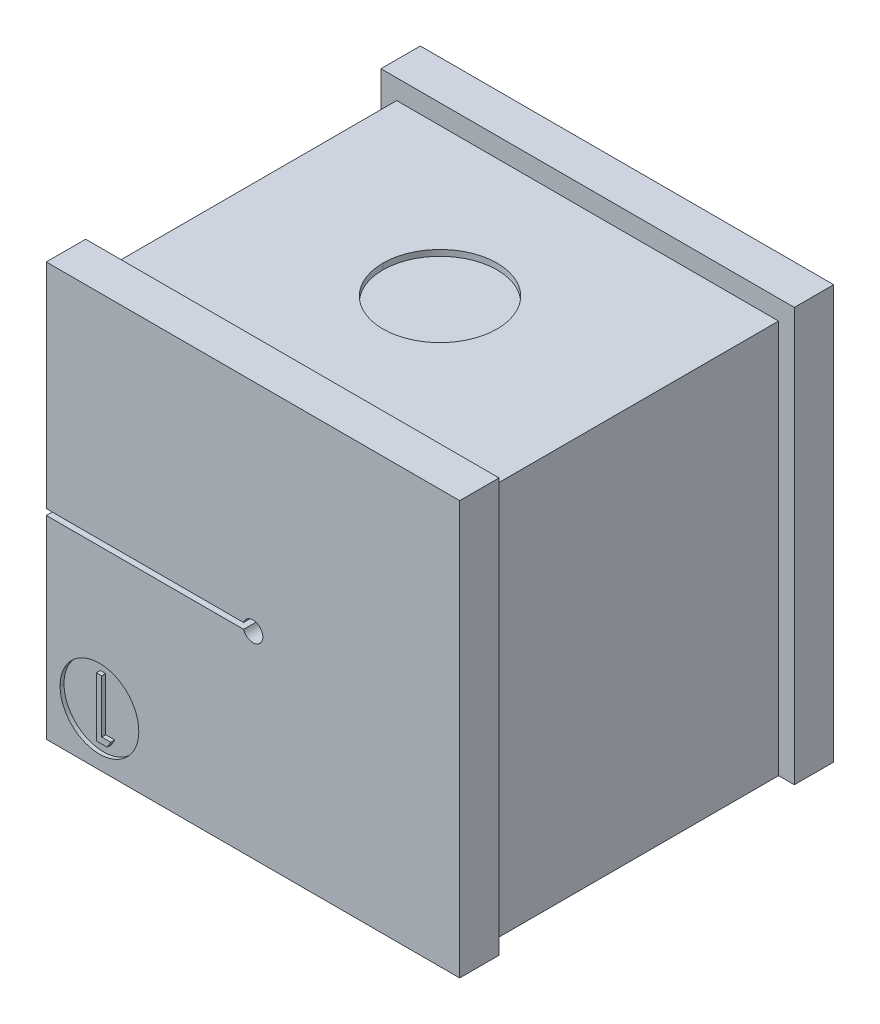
ISO-10303-21;
HEADER;
FILE_DESCRIPTION(('STEP AP214'),'2;1');
FILE_NAME('part.step','',(''),(''),'','','');
FILE_SCHEMA(('AUTOMOTIVE_DESIGN { 1 0 10303 214 1 1 1 1 }'));
ENDSEC;
DATA;
#1=APPLICATION_CONTEXT('core data for automotive mechanical design processes');
#2=APPLICATION_PROTOCOL_DEFINITION('international standard','automotive_design',2000,#1);
#3=PRODUCT_CONTEXT('',#1,'mechanical');
#4=PRODUCT('Part','Part','',(#3));
#5=PRODUCT_RELATED_PRODUCT_CATEGORY('part','',(#4));
#6=PRODUCT_DEFINITION_FORMATION('','',#4);
#7=PRODUCT_DEFINITION_CONTEXT('part definition',#1,'design');
#8=PRODUCT_DEFINITION('design','',#6,#7);
#9=PRODUCT_DEFINITION_SHAPE('','',#8);
#10=(LENGTH_UNIT() NAMED_UNIT(*) SI_UNIT(.MILLI.,.METRE.));
#11=(NAMED_UNIT(*) PLANE_ANGLE_UNIT() SI_UNIT($,.RADIAN.));
#12=(NAMED_UNIT(*) SI_UNIT($,.STERADIAN.) SOLID_ANGLE_UNIT());
#13=UNCERTAINTY_MEASURE_WITH_UNIT(LENGTH_MEASURE(1.E-05),#10,'distance_accuracy_value','');
#14=(GEOMETRIC_REPRESENTATION_CONTEXT(3) GLOBAL_UNCERTAINTY_ASSIGNED_CONTEXT((#13)) GLOBAL_UNIT_ASSIGNED_CONTEXT((#10,
#11,#12)) REPRESENTATION_CONTEXT('',''));
#15=CARTESIAN_POINT('',(0.,0.,0.));
#16=DIRECTION('',(0.,0.,1.));
#17=DIRECTION('',(1.,0.,0.));
#18=AXIS2_PLACEMENT_3D('',#15,#16,#17);
#19=CARTESIAN_POINT('',(0.,0.,9.5));
#20=DIRECTION('',(0.,0.,-1.));
#21=DIRECTION('',(0.,-1.,0.));
#22=AXIS2_PLACEMENT_3D('',#19,#20,#21);
#23=PLANE('',#22);
#24=DIRECTION('',(-0.496686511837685,-0.867930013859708,0.));
#25=VECTOR('',#24,1.);
#26=CARTESIAN_POINT('',(3.27692307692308,-8.99230769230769,9.5));
#27=LINE('',#26,#25);
#28=CARTESIAN_POINT('',(3.27692307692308,-8.99230769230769,9.5));
#29=VERTEX_POINT('',#28);
#30=CARTESIAN_POINT('',(3.10084134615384,-9.3,9.5));
#31=VERTEX_POINT('',#30);
#32=EDGE_CURVE('E396',#29,#31,#27,.T.);
#33=ORIENTED_EDGE('',*,*,#32,.F.);
#34=DIRECTION('',(1.,0.,0.));
#35=VECTOR('',#34,1.);
#36=CARTESIAN_POINT('',(2.81538461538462,-8.99230769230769,9.5));
#37=LINE('',#36,#35);
#38=CARTESIAN_POINT('',(2.81538461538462,-8.99230769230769,9.5));
#39=VERTEX_POINT('',#38);
#40=EDGE_CURVE('E18',#39,#29,#37,.T.);
#41=ORIENTED_EDGE('',*,*,#40,.F.);
#42=DIRECTION('',(0.,-1.,0.));
#43=VECTOR('',#42,1.);
#44=CARTESIAN_POINT('',(2.81538461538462,-6.3,9.5));
#45=LINE('',#44,#43);
#46=CARTESIAN_POINT('',(2.81538461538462,-6.3,9.5));
#47=VERTEX_POINT('',#46);
#48=EDGE_CURVE('E340',#47,#39,#45,.T.);
#49=ORIENTED_EDGE('',*,*,#48,.F.);
#50=DIRECTION('',(1.,0.,0.));
#51=VECTOR('',#50,1.);
#52=CARTESIAN_POINT('',(2.54615384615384,-6.3,9.5));
#53=LINE('',#52,#51);
#54=CARTESIAN_POINT('',(2.54615384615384,-6.3,9.5));
#55=VERTEX_POINT('',#54);
#56=EDGE_CURVE('E350',#55,#47,#53,.T.);
#57=ORIENTED_EDGE('',*,*,#56,.F.);
#58=DIRECTION('',(0.,1.,0.));
#59=VECTOR('',#58,1.);
#60=CARTESIAN_POINT('',(2.54615384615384,-9.3,9.5));
#61=LINE('',#60,#59);
#62=CARTESIAN_POINT('',(2.54615384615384,-9.3,9.5));
#63=VERTEX_POINT('',#62);
#64=EDGE_CURVE('E24',#63,#55,#61,.T.);
#65=ORIENTED_EDGE('',*,*,#64,.F.);
#66=DIRECTION('',(-1.,0.,0.));
#67=VECTOR('',#66,1.);
#68=CARTESIAN_POINT('',(3.10084134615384,-9.3,9.5));
#69=LINE('',#68,#67);
#70=EDGE_CURVE('E9',#31,#63,#69,.T.);
#71=ORIENTED_EDGE('',*,*,#70,.F.);
#72=EDGE_LOOP('',(#33,#41,#49,#57,#65,#71));
#73=FACE_BOUND('',#72,.T.);
#74=ADVANCED_FACE('F15',(#73),#23,.F.);
#75=CARTESIAN_POINT('',(3.10084134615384,-9.3,9.5));
#76=DIRECTION('',(0.,-1.,0.));
#77=DIRECTION('',(0.,0.,-1.));
#78=AXIS2_PLACEMENT_3D('',#75,#76,#77);
#79=PLANE('',#78);
#80=DIRECTION('',(-1.,0.,0.));
#81=VECTOR('',#80,1.);
#82=CARTESIAN_POINT('',(3.10084134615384,-9.3,9.3));
#83=LINE('',#82,#81);
#84=CARTESIAN_POINT('',(3.10084134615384,-9.3,9.3));
#85=VERTEX_POINT('',#84);
#86=CARTESIAN_POINT('',(2.54615384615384,-9.3,9.3));
#87=VERTEX_POINT('',#86);
#88=EDGE_CURVE('E387',#85,#87,#83,.T.);
#89=ORIENTED_EDGE('',*,*,#88,.F.);
#90=DIRECTION('',(0.,0.,-1.));
#91=VECTOR('',#90,1.);
#92=CARTESIAN_POINT('',(3.10084134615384,-9.3,9.5));
#93=LINE('',#92,#91);
#94=EDGE_CURVE('E400',#31,#85,#93,.T.);
#95=ORIENTED_EDGE('',*,*,#94,.F.);
#96=ORIENTED_EDGE('',*,*,#70,.T.);
#97=DIRECTION('',(0.,0.,-1.));
#98=VECTOR('',#97,1.);
#99=CARTESIAN_POINT('',(2.54615384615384,-9.3,9.5));
#100=LINE('',#99,#98);
#101=EDGE_CURVE('E353',#63,#87,#100,.T.);
#102=ORIENTED_EDGE('',*,*,#101,.T.);
#103=EDGE_LOOP('',(#89,#95,#96,#102));
#104=FACE_BOUND('',#103,.T.);
#105=ADVANCED_FACE('F671',(#104),#79,.T.);
#106=CARTESIAN_POINT('',(2.54615384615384,-9.3,9.5));
#107=DIRECTION('',(-1.,0.,0.));
#108=DIRECTION('',(0.,0.,1.));
#109=AXIS2_PLACEMENT_3D('',#106,#107,#108);
#110=PLANE('',#109);
#111=DIRECTION('',(0.,1.,0.));
#112=VECTOR('',#111,1.);
#113=CARTESIAN_POINT('',(2.54615384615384,-9.3,9.3));
#114=LINE('',#113,#112);
#115=CARTESIAN_POINT('',(2.54615384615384,-6.3,9.3));
#116=VERTEX_POINT('',#115);
#117=EDGE_CURVE('E382',#87,#116,#114,.T.);
#118=ORIENTED_EDGE('',*,*,#117,.F.);
#119=ORIENTED_EDGE('',*,*,#101,.F.);
#120=ORIENTED_EDGE('',*,*,#64,.T.);
#121=DIRECTION('',(0.,0.,-1.));
#122=VECTOR('',#121,1.);
#123=CARTESIAN_POINT('',(2.54615384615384,-6.3,9.5));
#124=LINE('',#123,#122);
#125=EDGE_CURVE('E343',#55,#116,#124,.T.);
#126=ORIENTED_EDGE('',*,*,#125,.T.);
#127=EDGE_LOOP('',(#118,#119,#120,#126));
#128=FACE_BOUND('',#127,.T.);
#129=ADVANCED_FACE('F672',(#128),#110,.T.);
#130=CARTESIAN_POINT('',(2.54615384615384,-6.3,9.5));
#131=DIRECTION('',(0.,1.,0.));
#132=DIRECTION('',(1.,0.,0.));
#133=AXIS2_PLACEMENT_3D('',#130,#131,#132);
#134=PLANE('',#133);
#135=DIRECTION('',(1.,0.,0.));
#136=VECTOR('',#135,1.);
#137=CARTESIAN_POINT('',(2.54615384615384,-6.3,9.3));
#138=LINE('',#137,#136);
#139=CARTESIAN_POINT('',(2.81538461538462,-6.3,9.3));
#140=VERTEX_POINT('',#139);
#141=EDGE_CURVE('E386',#116,#140,#138,.T.);
#142=ORIENTED_EDGE('',*,*,#141,.F.);
#143=ORIENTED_EDGE('',*,*,#125,.F.);
#144=ORIENTED_EDGE('',*,*,#56,.T.);
#145=DIRECTION('',(0.,0.,-1.));
#146=VECTOR('',#145,1.);
#147=CARTESIAN_POINT('',(2.81538461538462,-6.3,9.5));
#148=LINE('',#147,#146);
#149=EDGE_CURVE('E344',#47,#140,#148,.T.);
#150=ORIENTED_EDGE('',*,*,#149,.T.);
#151=EDGE_LOOP('',(#142,#143,#144,#150));
#152=FACE_BOUND('',#151,.T.);
#153=ADVANCED_FACE('F683',(#152),#134,.T.);
#154=CARTESIAN_POINT('',(2.81538461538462,-6.3,9.5));
#155=DIRECTION('',(1.,0.,0.));
#156=DIRECTION('',(0.,1.,0.));
#157=AXIS2_PLACEMENT_3D('',#154,#155,#156);
#158=PLANE('',#157);
#159=DIRECTION('',(0.,-1.,0.));
#160=VECTOR('',#159,1.);
#161=CARTESIAN_POINT('',(2.81538461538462,-6.3,9.3));
#162=LINE('',#161,#160);
#163=CARTESIAN_POINT('',(2.81538461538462,-8.99230769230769,9.3));
#164=VERTEX_POINT('',#163);
#165=EDGE_CURVE('E332',#140,#164,#162,.T.);
#166=ORIENTED_EDGE('',*,*,#165,.F.);
#167=ORIENTED_EDGE('',*,*,#149,.F.);
#168=ORIENTED_EDGE('',*,*,#48,.T.);
#169=DIRECTION('',(0.,0.,-1.));
#170=VECTOR('',#169,1.);
#171=CARTESIAN_POINT('',(2.81538461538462,-8.99230769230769,9.5));
#172=LINE('',#171,#170);
#173=EDGE_CURVE('E402',#39,#164,#172,.T.);
#174=ORIENTED_EDGE('',*,*,#173,.T.);
#175=EDGE_LOOP('',(#166,#167,#168,#174));
#176=FACE_BOUND('',#175,.T.);
#177=ADVANCED_FACE('F727',(#176),#158,.T.);
#178=CARTESIAN_POINT('',(2.81538461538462,-8.99230769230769,9.5));
#179=DIRECTION('',(0.,1.,0.));
#180=DIRECTION('',(1.,0.,0.));
#181=AXIS2_PLACEMENT_3D('',#178,#179,#180);
#182=PLANE('',#181);
#183=DIRECTION('',(1.,0.,0.));
#184=VECTOR('',#183,1.);
#185=CARTESIAN_POINT('',(2.81538461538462,-8.99230769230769,9.3));
#186=LINE('',#185,#184);
#187=CARTESIAN_POINT('',(3.27692307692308,-8.99230769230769,9.3));
#188=VERTEX_POINT('',#187);
#189=EDGE_CURVE('E327',#164,#188,#186,.T.);
#190=ORIENTED_EDGE('',*,*,#189,.F.);
#191=ORIENTED_EDGE('',*,*,#173,.F.);
#192=ORIENTED_EDGE('',*,*,#40,.T.);
#193=DIRECTION('',(0.,0.,-1.));
#194=VECTOR('',#193,1.);
#195=CARTESIAN_POINT('',(3.27692307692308,-8.99230769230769,9.5));
#196=LINE('',#195,#194);
#197=EDGE_CURVE('E331',#29,#188,#196,.T.);
#198=ORIENTED_EDGE('',*,*,#197,.T.);
#199=EDGE_LOOP('',(#190,#191,#192,#198));
#200=FACE_BOUND('',#199,.T.);
#201=ADVANCED_FACE('F730',(#200),#182,.T.);
#202=CARTESIAN_POINT('',(3.27692307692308,-8.99230769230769,9.5));
#203=DIRECTION('',(0.867930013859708,-0.496686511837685,0.));
#204=DIRECTION('',(0.,0.,-1.));
#205=AXIS2_PLACEMENT_3D('',#202,#203,#204);
#206=PLANE('',#205);
#207=DIRECTION('',(-0.496686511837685,-0.867930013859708,0.));
#208=VECTOR('',#207,1.);
#209=CARTESIAN_POINT('',(3.27692307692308,-8.99230769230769,9.3));
#210=LINE('',#209,#208);
#211=EDGE_CURVE('E435',#188,#85,#210,.T.);
#212=ORIENTED_EDGE('',*,*,#211,.F.);
#213=ORIENTED_EDGE('',*,*,#197,.F.);
#214=ORIENTED_EDGE('',*,*,#32,.T.);
#215=ORIENTED_EDGE('',*,*,#94,.T.);
#216=EDGE_LOOP('',(#212,#213,#214,#215));
#217=FACE_BOUND('',#216,.T.);
#218=ADVANCED_FACE('F680',(#217),#206,.T.);
#219=CARTESIAN_POINT('',(10.5,-0.5,-10.9142135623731));
#220=DIRECTION('',(0.,0.,1.));
#221=DIRECTION('',(1.,0.,0.));
#222=AXIS2_PLACEMENT_3D('',#219,#220,#221);
#223=CYLINDRICAL_SURFACE('',#222,0.5);
#224=DIRECTION('',(0.,0.,1.));
#225=VECTOR('',#224,1.);
#226=CARTESIAN_POINT('',(11.,-0.5,-10.9142135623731));
#227=LINE('',#226,#225);
#228=CARTESIAN_POINT('',(11.,-0.5,-9.5));
#229=VERTEX_POINT('',#228);
#230=CARTESIAN_POINT('',(11.,-0.5,9.5));
#231=VERTEX_POINT('',#230);
#232=EDGE_CURVE('E651',#229,#231,#227,.T.);
#233=ORIENTED_EDGE('',*,*,#232,.F.);
#234=CARTESIAN_POINT('',(10.5,-0.5,-9.5));
#235=DIRECTION('',(0.,0.,1.));
#236=DIRECTION('',(-1.,0.,0.));
#237=AXIS2_PLACEMENT_3D('',#234,#235,#236);
#238=CIRCLE('',#237,0.5);
#239=CARTESIAN_POINT('',(10.0230303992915,-0.65,-9.5));
#240=VERTEX_POINT('',#239);
#241=EDGE_CURVE('E375',#240,#229,#238,.T.);
#242=ORIENTED_EDGE('',*,*,#241,.F.);
#243=DIRECTION('',(0.,0.,1.));
#244=VECTOR('',#243,1.);
#245=CARTESIAN_POINT('',(10.0230303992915,-0.65,-10.9142135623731));
#246=LINE('',#245,#244);
#247=CARTESIAN_POINT('',(10.0230303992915,-0.65,9.5));
#248=VERTEX_POINT('',#247);
#249=EDGE_CURVE('E534',#240,#248,#246,.T.);
#250=ORIENTED_EDGE('',*,*,#249,.T.);
#251=CARTESIAN_POINT('',(10.5,-0.5,9.5));
#252=DIRECTION('',(0.,0.,1.));
#253=DIRECTION('',(1.,0.,0.));
#254=AXIS2_PLACEMENT_3D('',#251,#252,#253);
#255=CIRCLE('',#254,0.5);
#256=EDGE_CURVE('E371',#248,#231,#255,.T.);
#257=ORIENTED_EDGE('',*,*,#256,.T.);
#258=EDGE_LOOP('',(#233,#242,#250,#257));
#259=FACE_BOUND('',#258,.T.);
#260=ADVANCED_FACE('F735',(#259),#223,.F.);
#261=CARTESIAN_POINT('',(2.7,-7.8,9.3));
#262=DIRECTION('',(0.,0.,1.));
#263=DIRECTION('',(1.,0.,0.));
#264=AXIS2_PLACEMENT_3D('',#261,#262,#263);
#265=PLANE('',#264);
#266=ORIENTED_EDGE('',*,*,#211,.T.);
#267=ORIENTED_EDGE('',*,*,#88,.T.);
#268=ORIENTED_EDGE('',*,*,#117,.T.);
#269=ORIENTED_EDGE('',*,*,#141,.T.);
#270=ORIENTED_EDGE('',*,*,#165,.T.);
#271=ORIENTED_EDGE('',*,*,#189,.T.);
#272=EDGE_LOOP('',(#266,#267,#268,#269,#270,#271));
#273=FACE_BOUND('',#272,.T.);
#274=CARTESIAN_POINT('',(2.7,-7.8,9.3));
#275=DIRECTION('',(0.,0.,1.));
#276=DIRECTION('',(1.,0.,0.));
#277=AXIS2_PLACEMENT_3D('',#274,#275,#276);
#278=CIRCLE('',#277,2.);
#279=CARTESIAN_POINT('',(4.7,-7.8,9.3));
#280=VERTEX_POINT('',#279);
#281=CARTESIAN_POINT('',(0.7,-7.8,9.3));
#282=VERTEX_POINT('',#281);
#283=EDGE_CURVE('E381',#280,#282,#278,.T.);
#284=ORIENTED_EDGE('',*,*,#283,.T.);
#285=CARTESIAN_POINT('',(2.7,-7.8,9.3));
#286=DIRECTION('',(0.,0.,1.));
#287=DIRECTION('',(1.,0.,0.));
#288=AXIS2_PLACEMENT_3D('',#285,#286,#287);
#289=CIRCLE('',#288,2.);
#290=EDGE_CURVE('E533',#282,#280,#289,.T.);
#291=ORIENTED_EDGE('',*,*,#290,.T.);
#292=EDGE_LOOP('',(#284,#291));
#293=FACE_BOUND('',#292,.T.);
#294=ADVANCED_FACE('F675',(#273,#293),#265,.T.);
#295=CARTESIAN_POINT('',(2.7,-7.8,9.3));
#296=DIRECTION('',(0.,0.,1.));
#297=DIRECTION('',(1.,0.,0.));
#298=AXIS2_PLACEMENT_3D('',#295,#296,#297);
#299=CYLINDRICAL_SURFACE('',#298,2.);
#300=DIRECTION('',(0.,0.,1.));
#301=VECTOR('',#300,1.);
#302=CARTESIAN_POINT('',(0.7,-7.8,9.3));
#303=LINE('',#302,#301);
#304=CARTESIAN_POINT('',(0.7,-7.8,9.5));
#305=VERTEX_POINT('',#304);
#306=EDGE_CURVE('E529',#282,#305,#303,.T.);
#307=ORIENTED_EDGE('',*,*,#306,.F.);
#308=ORIENTED_EDGE('',*,*,#283,.F.);
#309=DIRECTION('',(0.,0.,1.));
#310=VECTOR('',#309,1.);
#311=CARTESIAN_POINT('',(4.7,-7.8,9.3));
#312=LINE('',#311,#310);
#313=CARTESIAN_POINT('',(4.7,-7.8,9.5));
#314=VERTEX_POINT('',#313);
#315=EDGE_CURVE('E545',#280,#314,#312,.T.);
#316=ORIENTED_EDGE('',*,*,#315,.T.);
#317=CARTESIAN_POINT('',(2.7,-7.8,9.5));
#318=DIRECTION('',(0.,0.,1.));
#319=DIRECTION('',(1.,0.,0.));
#320=AXIS2_PLACEMENT_3D('',#317,#318,#319);
#321=CIRCLE('',#320,2.);
#322=EDGE_CURVE('E374',#314,#305,#321,.T.);
#323=ORIENTED_EDGE('',*,*,#322,.T.);
#324=EDGE_LOOP('',(#307,#308,#316,#323));
#325=FACE_BOUND('',#324,.T.);
#326=ADVANCED_FACE('F739',(#325),#299,.F.);
#327=CARTESIAN_POINT('',(10.5,9.2,0.));
#328=DIRECTION('',(0.,1.,0.));
#329=DIRECTION('',(-1.,0.,0.));
#330=AXIS2_PLACEMENT_3D('',#327,#328,#329);
#331=CYLINDRICAL_SURFACE('',#330,2.9);
#332=DIRECTION('',(0.,1.,0.));
#333=VECTOR('',#332,1.);
#334=CARTESIAN_POINT('',(13.4,9.2,0.));
#335=LINE('',#334,#333);
#336=CARTESIAN_POINT('',(13.4,9.2,0.));
#337=VERTEX_POINT('',#336);
#338=CARTESIAN_POINT('',(13.4,9.5,0.));
#339=VERTEX_POINT('',#338);
#340=EDGE_CURVE('E562',#337,#339,#335,.T.);
#341=ORIENTED_EDGE('',*,*,#340,.F.);
#342=CARTESIAN_POINT('',(10.5,9.2,0.));
#343=DIRECTION('',(0.,1.,0.));
#344=DIRECTION('',(-1.,0.,0.));
#345=AXIS2_PLACEMENT_3D('',#342,#343,#344);
#346=CIRCLE('',#345,2.9);
#347=CARTESIAN_POINT('',(7.6,9.2,0.));
#348=VERTEX_POINT('',#347);
#349=EDGE_CURVE('E378',#348,#337,#346,.T.);
#350=ORIENTED_EDGE('',*,*,#349,.F.);
#351=DIRECTION('',(0.,1.,0.));
#352=VECTOR('',#351,1.);
#353=CARTESIAN_POINT('',(7.6,9.2,0.));
#354=LINE('',#353,#352);
#355=CARTESIAN_POINT('',(7.6,9.5,0.));
#356=VERTEX_POINT('',#355);
#357=EDGE_CURVE('E563',#348,#356,#354,.T.);
#358=ORIENTED_EDGE('',*,*,#357,.T.);
#359=CARTESIAN_POINT('',(10.5,9.5,0.));
#360=DIRECTION('',(0.,-1.,0.));
#361=DIRECTION('',(1.,0.,0.));
#362=AXIS2_PLACEMENT_3D('',#359,#360,#361);
#363=CIRCLE('',#362,2.9);
#364=EDGE_CURVE('E312',#339,#356,#363,.T.);
#365=ORIENTED_EDGE('',*,*,#364,.F.);
#366=EDGE_LOOP('',(#341,#350,#358,#365));
#367=FACE_BOUND('',#366,.T.);
#368=ADVANCED_FACE('F702',(#367),#331,.F.);
#369=CARTESIAN_POINT('',(10.5,9.2,0.));
#370=DIRECTION('',(0.,1.,0.));
#371=DIRECTION('',(1.,0.,0.));
#372=AXIS2_PLACEMENT_3D('',#369,#370,#371);
#373=PLANE('',#372);
#374=ORIENTED_EDGE('',*,*,#349,.T.);
#375=CARTESIAN_POINT('',(10.5,9.2,0.));
#376=DIRECTION('',(0.,1.,0.));
#377=DIRECTION('',(-1.,0.,0.));
#378=AXIS2_PLACEMENT_3D('',#375,#376,#377);
#379=CIRCLE('',#378,2.9);
#380=EDGE_CURVE('E555',#337,#348,#379,.T.);
#381=ORIENTED_EDGE('',*,*,#380,.T.);
#382=EDGE_LOOP('',(#374,#381));
#383=FACE_BOUND('',#382,.T.);
#384=ADVANCED_FACE('F738',(#383),#373,.T.);
#385=CARTESIAN_POINT('',(1.3,0.,7.5));
#386=DIRECTION('',(0.,0.,1.));
#387=DIRECTION('',(1.,0.,0.));
#388=AXIS2_PLACEMENT_3D('',#385,#386,#387);
#389=PLANE('',#388);
#390=DIRECTION('',(0.,1.,0.));
#391=VECTOR('',#390,1.);
#392=CARTESIAN_POINT('',(0.,0.,7.5));
#393=LINE('',#392,#391);
#394=CARTESIAN_POINT('',(0.,-10.5,7.5));
#395=VERTEX_POINT('',#394);
#396=CARTESIAN_POINT('',(0.,-0.65,7.5));
#397=VERTEX_POINT('',#396);
#398=EDGE_CURVE('E358',#395,#397,#393,.T.);
#399=ORIENTED_EDGE('',*,*,#398,.T.);
#400=DIRECTION('',(1.,0.,0.));
#401=VECTOR('',#400,1.);
#402=CARTESIAN_POINT('',(1.3,-0.65,7.5));
#403=LINE('',#402,#401);
#404=CARTESIAN_POINT('',(0.8,-0.65,7.5));
#405=VERTEX_POINT('',#404);
#406=EDGE_CURVE('E584',#397,#405,#403,.T.);
#407=ORIENTED_EDGE('',*,*,#406,.T.);
#408=DIRECTION('',(0.,1.,0.));
#409=VECTOR('',#408,1.);
#410=CARTESIAN_POINT('',(0.8,9.5,7.5));
#411=LINE('',#410,#409);
#412=CARTESIAN_POINT('',(0.8,-10.5,7.5));
#413=VERTEX_POINT('',#412);
#414=EDGE_CURVE('E365',#413,#405,#411,.T.);
#415=ORIENTED_EDGE('',*,*,#414,.F.);
#416=DIRECTION('',(1.,0.,0.));
#417=VECTOR('',#416,1.);
#418=CARTESIAN_POINT('',(1.3,-10.5,7.5));
#419=LINE('',#418,#417);
#420=EDGE_CURVE('E349',#395,#413,#419,.T.);
#421=ORIENTED_EDGE('',*,*,#420,.F.);
#422=EDGE_LOOP('',(#399,#407,#415,#421));
#423=FACE_BOUND('',#422,.T.);
#424=ADVANCED_FACE('F742',(#423),#389,.F.);
#425=CARTESIAN_POINT('',(0.,0.,-7.5));
#426=DIRECTION('',(0.,0.,-1.));
#427=DIRECTION('',(-1.,0.,0.));
#428=AXIS2_PLACEMENT_3D('',#425,#426,#427);
#429=PLANE('',#428);
#430=DIRECTION('',(0.,-1.,0.));
#431=VECTOR('',#430,1.);
#432=CARTESIAN_POINT('',(0.8,9.5,-7.5));
#433=LINE('',#432,#431);
#434=CARTESIAN_POINT('',(0.8,-0.65,-7.5));
#435=VERTEX_POINT('',#434);
#436=CARTESIAN_POINT('',(0.8,-10.5,-7.5));
#437=VERTEX_POINT('',#436);
#438=EDGE_CURVE('E368',#435,#437,#433,.T.);
#439=ORIENTED_EDGE('',*,*,#438,.F.);
#440=DIRECTION('',(-1.,0.,0.));
#441=VECTOR('',#440,1.);
#442=CARTESIAN_POINT('',(0.,-0.65,-7.5));
#443=LINE('',#442,#441);
#444=CARTESIAN_POINT('',(0.,-0.65,-7.5));
#445=VERTEX_POINT('',#444);
#446=EDGE_CURVE('E576',#435,#445,#443,.T.);
#447=ORIENTED_EDGE('',*,*,#446,.T.);
#448=DIRECTION('',(0.,1.,0.));
#449=VECTOR('',#448,1.);
#450=CARTESIAN_POINT('',(0.,0.,-7.5));
#451=LINE('',#450,#449);
#452=CARTESIAN_POINT('',(0.,-10.5,-7.5));
#453=VERTEX_POINT('',#452);
#454=EDGE_CURVE('E359',#453,#445,#451,.T.);
#455=ORIENTED_EDGE('',*,*,#454,.F.);
#456=DIRECTION('',(-1.,0.,0.));
#457=VECTOR('',#456,1.);
#458=CARTESIAN_POINT('',(0.,-10.5,-7.5));
#459=LINE('',#458,#457);
#460=EDGE_CURVE('E339',#437,#453,#459,.T.);
#461=ORIENTED_EDGE('',*,*,#460,.F.);
#462=EDGE_LOOP('',(#439,#447,#455,#461));
#463=FACE_BOUND('',#462,.T.);
#464=ADVANCED_FACE('F746',(#463),#429,.F.);
#465=CARTESIAN_POINT('',(0.,0.,-9.5));
#466=DIRECTION('',(0.,0.,-1.));
#467=DIRECTION('',(0.,-1.,0.));
#468=AXIS2_PLACEMENT_3D('',#465,#466,#467);
#469=PLANE('',#468);
#470=DIRECTION('',(-1.,0.,0.));
#471=VECTOR('',#470,1.);
#472=CARTESIAN_POINT('',(0.,-0.35,-9.5));
#473=LINE('',#472,#471);
#474=CARTESIAN_POINT('',(10.0230303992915,-0.35,-9.5));
#475=VERTEX_POINT('',#474);
#476=CARTESIAN_POINT('',(0.,-0.35,-9.5));
#477=VERTEX_POINT('',#476);
#478=EDGE_CURVE('E595',#475,#477,#473,.T.);
#479=ORIENTED_EDGE('',*,*,#478,.T.);
#480=DIRECTION('',(0.,-1.,0.));
#481=VECTOR('',#480,1.);
#482=CARTESIAN_POINT('',(0.,0.,-9.5));
#483=LINE('',#482,#481);
#484=CARTESIAN_POINT('',(0.,10.5,-9.5));
#485=VERTEX_POINT('',#484);
#486=EDGE_CURVE('E431',#485,#477,#483,.T.);
#487=ORIENTED_EDGE('',*,*,#486,.F.);
#488=DIRECTION('',(-1.,0.,0.));
#489=VECTOR('',#488,1.);
#490=CARTESIAN_POINT('',(0.,10.5,-9.5));
#491=LINE('',#490,#489);
#492=CARTESIAN_POINT('',(21.,10.5,-9.5));
#493=VERTEX_POINT('',#492);
#494=EDGE_CURVE('E323',#493,#485,#491,.T.);
#495=ORIENTED_EDGE('',*,*,#494,.F.);
#496=DIRECTION('',(0.,-1.,0.));
#497=VECTOR('',#496,1.);
#498=CARTESIAN_POINT('',(21.,0.,-9.5));
#499=LINE('',#498,#497);
#500=CARTESIAN_POINT('',(21.,-10.5,-9.5));
#501=VERTEX_POINT('',#500);
#502=EDGE_CURVE('E295',#493,#501,#499,.T.);
#503=ORIENTED_EDGE('',*,*,#502,.T.);
#504=DIRECTION('',(-1.,0.,0.));
#505=VECTOR('',#504,1.);
#506=CARTESIAN_POINT('',(0.,-10.5,-9.5));
#507=LINE('',#506,#505);
#508=CARTESIAN_POINT('',(0.,-10.5,-9.5));
#509=VERTEX_POINT('',#508);
#510=EDGE_CURVE('E467',#501,#509,#507,.T.);
#511=ORIENTED_EDGE('',*,*,#510,.T.);
#512=DIRECTION('',(0.,-1.,0.));
#513=VECTOR('',#512,1.);
#514=CARTESIAN_POINT('',(0.,0.,-9.5));
#515=LINE('',#514,#513);
#516=CARTESIAN_POINT('',(0.,-0.65,-9.5));
#517=VERTEX_POINT('',#516);
#518=EDGE_CURVE('E362',#517,#509,#515,.T.);
#519=ORIENTED_EDGE('',*,*,#518,.F.);
#520=DIRECTION('',(1.,0.,0.));
#521=VECTOR('',#520,1.);
#522=CARTESIAN_POINT('',(0.,-0.65,-9.5));
#523=LINE('',#522,#521);
#524=EDGE_CURVE('E538',#517,#240,#523,.T.);
#525=ORIENTED_EDGE('',*,*,#524,.T.);
#526=ORIENTED_EDGE('',*,*,#241,.T.);
#527=CARTESIAN_POINT('',(10.5,-0.5,-9.5));
#528=DIRECTION('',(0.,0.,1.));
#529=DIRECTION('',(-1.,0.,0.));
#530=AXIS2_PLACEMENT_3D('',#527,#528,#529);
#531=CIRCLE('',#530,0.5);
#532=EDGE_CURVE('E658',#229,#475,#531,.T.);
#533=ORIENTED_EDGE('',*,*,#532,.T.);
#534=EDGE_LOOP('',(#479,#487,#495,#503,#511,#519,#525,#526,#533));
#535=FACE_BOUND('',#534,.T.);
#536=ADVANCED_FACE('F750',(#535),#469,.T.);
#537=CARTESIAN_POINT('',(0.,0.,9.5));
#538=DIRECTION('',(0.,0.,-1.));
#539=DIRECTION('',(0.,-1.,0.));
#540=AXIS2_PLACEMENT_3D('',#537,#538,#539);
#541=PLANE('',#540);
#542=ORIENTED_EDGE('',*,*,#322,.F.);
#543=CARTESIAN_POINT('',(2.7,-7.8,9.5));
#544=DIRECTION('',(0.,0.,1.));
#545=DIRECTION('',(1.,0.,0.));
#546=AXIS2_PLACEMENT_3D('',#543,#544,#545);
#547=CIRCLE('',#546,2.);
#548=EDGE_CURVE('E532',#305,#314,#547,.T.);
#549=ORIENTED_EDGE('',*,*,#548,.F.);
#550=EDGE_LOOP('',(#542,#549));
#551=FACE_BOUND('',#550,.T.);
#552=DIRECTION('',(0.,-1.,0.));
#553=VECTOR('',#552,1.);
#554=CARTESIAN_POINT('',(0.,0.,9.5));
#555=LINE('',#554,#553);
#556=CARTESIAN_POINT('',(0.,10.5,9.5));
#557=VERTEX_POINT('',#556);
#558=CARTESIAN_POINT('',(0.,-0.35,9.5));
#559=VERTEX_POINT('',#558);
#560=EDGE_CURVE('E425',#557,#559,#555,.T.);
#561=ORIENTED_EDGE('',*,*,#560,.T.);
#562=DIRECTION('',(-1.,0.,0.));
#563=VECTOR('',#562,1.);
#564=CARTESIAN_POINT('',(0.,-0.35,9.5));
#565=LINE('',#564,#563);
#566=CARTESIAN_POINT('',(10.0230303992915,-0.35,9.5));
#567=VERTEX_POINT('',#566);
#568=EDGE_CURVE('E599',#567,#559,#565,.T.);
#569=ORIENTED_EDGE('',*,*,#568,.F.);
#570=CARTESIAN_POINT('',(10.5,-0.5,9.5));
#571=DIRECTION('',(0.,0.,1.));
#572=DIRECTION('',(1.,0.,0.));
#573=AXIS2_PLACEMENT_3D('',#570,#571,#572);
#574=CIRCLE('',#573,0.5);
#575=EDGE_CURVE('E646',#231,#567,#574,.T.);
#576=ORIENTED_EDGE('',*,*,#575,.F.);
#577=ORIENTED_EDGE('',*,*,#256,.F.);
#578=DIRECTION('',(1.,0.,0.));
#579=VECTOR('',#578,1.);
#580=CARTESIAN_POINT('',(0.,-0.65,9.5));
#581=LINE('',#580,#579);
#582=CARTESIAN_POINT('',(0.,-0.65,9.5));
#583=VERTEX_POINT('',#582);
#584=EDGE_CURVE('E539',#583,#248,#581,.T.);
#585=ORIENTED_EDGE('',*,*,#584,.F.);
#586=DIRECTION('',(0.,-1.,0.));
#587=VECTOR('',#586,1.);
#588=CARTESIAN_POINT('',(0.,0.,9.5));
#589=LINE('',#588,#587);
#590=CARTESIAN_POINT('',(0.,-10.5,9.5));
#591=VERTEX_POINT('',#590);
#592=EDGE_CURVE('E294',#583,#591,#589,.T.);
#593=ORIENTED_EDGE('',*,*,#592,.T.);
#594=DIRECTION('',(-1.,0.,0.));
#595=VECTOR('',#594,1.);
#596=CARTESIAN_POINT('',(0.,-10.5,9.5));
#597=LINE('',#596,#595);
#598=CARTESIAN_POINT('',(21.,-10.5,9.5));
#599=VERTEX_POINT('',#598);
#600=EDGE_CURVE('E289',#599,#591,#597,.T.);
#601=ORIENTED_EDGE('',*,*,#600,.F.);
#602=DIRECTION('',(0.,-1.,0.));
#603=VECTOR('',#602,1.);
#604=CARTESIAN_POINT('',(21.,0.,9.5));
#605=LINE('',#604,#603);
#606=CARTESIAN_POINT('',(21.,10.5,9.5));
#607=VERTEX_POINT('',#606);
#608=EDGE_CURVE('E283',#607,#599,#605,.T.);
#609=ORIENTED_EDGE('',*,*,#608,.F.);
#610=DIRECTION('',(-1.,0.,0.));
#611=VECTOR('',#610,1.);
#612=CARTESIAN_POINT('',(0.,10.5,9.5));
#613=LINE('',#612,#611);
#614=EDGE_CURVE('E286',#607,#557,#613,.T.);
#615=ORIENTED_EDGE('',*,*,#614,.T.);
#616=EDGE_LOOP('',(#561,#569,#576,#577,#585,#593,#601,#609,#615));
#617=FACE_BOUND('',#616,.T.);
#618=ADVANCED_FACE('F285',(#551,#617),#541,.F.);
#619=CARTESIAN_POINT('',(0.8,0.,1.75));
#620=DIRECTION('',(1.,0.,0.));
#621=DIRECTION('',(0.,0.,-1.));
#622=AXIS2_PLACEMENT_3D('',#619,#620,#621);
#623=PLANE('',#622);
#624=ORIENTED_EDGE('',*,*,#414,.T.);
#625=DIRECTION('',(0.,0.,-1.));
#626=VECTOR('',#625,1.);
#627=CARTESIAN_POINT('',(0.8,-0.65,1.75));
#628=LINE('',#627,#626);
#629=EDGE_CURVE('E580',#405,#435,#628,.T.);
#630=ORIENTED_EDGE('',*,*,#629,.T.);
#631=ORIENTED_EDGE('',*,*,#438,.T.);
#632=DIRECTION('',(0.,0.,-1.));
#633=VECTOR('',#632,1.);
#634=CARTESIAN_POINT('',(0.8,-10.5,1.75));
#635=LINE('',#634,#633);
#636=EDGE_CURVE('E335',#413,#437,#635,.T.);
#637=ORIENTED_EDGE('',*,*,#636,.F.);
#638=EDGE_LOOP('',(#624,#630,#631,#637));
#639=FACE_BOUND('',#638,.T.);
#640=ADVANCED_FACE('F757',(#639),#623,.F.);
#641=CARTESIAN_POINT('',(0.,0.,9.5));
#642=DIRECTION('',(1.,0.,0.));
#643=DIRECTION('',(0.,1.,0.));
#644=AXIS2_PLACEMENT_3D('',#641,#642,#643);
#645=PLANE('',#644);
#646=ORIENTED_EDGE('',*,*,#454,.T.);
#647=DIRECTION('',(0.,0.,1.));
#648=VECTOR('',#647,1.);
#649=CARTESIAN_POINT('',(0.,-0.65,-9.5));
#650=LINE('',#649,#648);
#651=EDGE_CURVE('E549',#517,#445,#650,.T.);
#652=ORIENTED_EDGE('',*,*,#651,.F.);
#653=ORIENTED_EDGE('',*,*,#518,.T.);
#654=DIRECTION('',(0.,0.,-1.));
#655=VECTOR('',#654,1.);
#656=CARTESIAN_POINT('',(0.,-10.5,9.5));
#657=LINE('',#656,#655);
#658=EDGE_CURVE('E463',#453,#509,#657,.T.);
#659=ORIENTED_EDGE('',*,*,#658,.F.);
#660=EDGE_LOOP('',(#646,#652,#653,#659));
#661=FACE_BOUND('',#660,.T.);
#662=ADVANCED_FACE('F761',(#661),#645,.F.);
#663=CARTESIAN_POINT('',(0.,0.,9.5));
#664=DIRECTION('',(1.,0.,0.));
#665=DIRECTION('',(0.,1.,0.));
#666=AXIS2_PLACEMENT_3D('',#663,#664,#665);
#667=PLANE('',#666);
#668=ORIENTED_EDGE('',*,*,#592,.F.);
#669=DIRECTION('',(0.,0.,1.));
#670=VECTOR('',#669,1.);
#671=CARTESIAN_POINT('',(0.,-0.65,-9.5));
#672=LINE('',#671,#670);
#673=EDGE_CURVE('E588',#397,#583,#672,.T.);
#674=ORIENTED_EDGE('',*,*,#673,.F.);
#675=ORIENTED_EDGE('',*,*,#398,.F.);
#676=DIRECTION('',(0.,0.,-1.));
#677=VECTOR('',#676,1.);
#678=CARTESIAN_POINT('',(0.,-10.5,9.5));
#679=LINE('',#678,#677);
#680=EDGE_CURVE('E345',#591,#395,#679,.T.);
#681=ORIENTED_EDGE('',*,*,#680,.F.);
#682=EDGE_LOOP('',(#668,#674,#675,#681));
#683=FACE_BOUND('',#682,.T.);
#684=ADVANCED_FACE('F765',(#683),#667,.F.);
#685=CARTESIAN_POINT('',(21.,0.,9.5));
#686=DIRECTION('',(1.,0.,0.));
#687=DIRECTION('',(0.,1.,0.));
#688=AXIS2_PLACEMENT_3D('',#685,#686,#687);
#689=PLANE('',#688);
#690=DIRECTION('',(0.,0.,-1.));
#691=VECTOR('',#690,1.);
#692=CARTESIAN_POINT('',(21.,-10.5,9.5));
#693=LINE('',#692,#691);
#694=CARTESIAN_POINT('',(21.,-10.5,7.5));
#695=VERTEX_POINT('',#694);
#696=EDGE_CURVE('E428',#599,#695,#693,.T.);
#697=ORIENTED_EDGE('',*,*,#696,.T.);
#698=DIRECTION('',(0.,1.,0.));
#699=VECTOR('',#698,1.);
#700=CARTESIAN_POINT('',(21.,-10.5,7.5));
#701=LINE('',#700,#699);
#702=CARTESIAN_POINT('',(21.,10.5,7.5));
#703=VERTEX_POINT('',#702);
#704=EDGE_CURVE('E309',#695,#703,#701,.T.);
#705=ORIENTED_EDGE('',*,*,#704,.T.);
#706=DIRECTION('',(0.,0.,-1.));
#707=VECTOR('',#706,1.);
#708=CARTESIAN_POINT('',(21.,10.5,9.5));
#709=LINE('',#708,#707);
#710=EDGE_CURVE('E299',#607,#703,#709,.T.);
#711=ORIENTED_EDGE('',*,*,#710,.F.);
#712=ORIENTED_EDGE('',*,*,#608,.T.);
#713=EDGE_LOOP('',(#697,#705,#711,#712));
#714=FACE_BOUND('',#713,.T.);
#715=ADVANCED_FACE('F307',(#714),#689,.T.);
#716=CARTESIAN_POINT('',(21.,0.,9.5));
#717=DIRECTION('',(1.,0.,0.));
#718=DIRECTION('',(0.,1.,0.));
#719=AXIS2_PLACEMENT_3D('',#716,#717,#718);
#720=PLANE('',#719);
#721=DIRECTION('',(0.,1.,0.));
#722=VECTOR('',#721,1.);
#723=CARTESIAN_POINT('',(21.,-10.5,-7.5));
#724=LINE('',#723,#722);
#725=CARTESIAN_POINT('',(21.,-10.5,-7.5));
#726=VERTEX_POINT('',#725);
#727=CARTESIAN_POINT('',(21.,10.5,-7.5));
#728=VERTEX_POINT('',#727);
#729=EDGE_CURVE('E468',#726,#728,#724,.T.);
#730=ORIENTED_EDGE('',*,*,#729,.F.);
#731=DIRECTION('',(0.,0.,-1.));
#732=VECTOR('',#731,1.);
#733=CARTESIAN_POINT('',(21.,-10.5,9.5));
#734=LINE('',#733,#732);
#735=EDGE_CURVE('E512',#726,#501,#734,.T.);
#736=ORIENTED_EDGE('',*,*,#735,.T.);
#737=ORIENTED_EDGE('',*,*,#502,.F.);
#738=DIRECTION('',(0.,0.,-1.));
#739=VECTOR('',#738,1.);
#740=CARTESIAN_POINT('',(21.,10.5,9.5));
#741=LINE('',#740,#739);
#742=EDGE_CURVE('E305',#728,#493,#741,.T.);
#743=ORIENTED_EDGE('',*,*,#742,.F.);
#744=EDGE_LOOP('',(#730,#736,#737,#743));
#745=FACE_BOUND('',#744,.T.);
#746=ADVANCED_FACE('F768',(#745),#720,.T.);
#747=CARTESIAN_POINT('',(0.,-10.5,9.5));
#748=DIRECTION('',(0.,-1.,0.));
#749=DIRECTION('',(0.,0.,-1.));
#750=AXIS2_PLACEMENT_3D('',#747,#748,#749);
#751=PLANE('',#750);
#752=ORIENTED_EDGE('',*,*,#636,.T.);
#753=ORIENTED_EDGE('',*,*,#460,.T.);
#754=ORIENTED_EDGE('',*,*,#658,.T.);
#755=ORIENTED_EDGE('',*,*,#510,.F.);
#756=ORIENTED_EDGE('',*,*,#735,.F.);
#757=DIRECTION('',(1.,0.,0.));
#758=VECTOR('',#757,1.);
#759=CARTESIAN_POINT('',(21.,-10.5,-7.5));
#760=LINE('',#759,#758);
#761=CARTESIAN_POINT('',(20.2,-10.5,-7.5));
#762=VERTEX_POINT('',#761);
#763=EDGE_CURVE('E462',#762,#726,#760,.T.);
#764=ORIENTED_EDGE('',*,*,#763,.F.);
#765=DIRECTION('',(0.,0.,-1.));
#766=VECTOR('',#765,1.);
#767=CARTESIAN_POINT('',(20.2,-10.5,1.75));
#768=LINE('',#767,#766);
#769=CARTESIAN_POINT('',(20.2,-10.5,7.5));
#770=VERTEX_POINT('',#769);
#771=EDGE_CURVE('E326',#770,#762,#768,.T.);
#772=ORIENTED_EDGE('',*,*,#771,.F.);
#773=DIRECTION('',(-1.,0.,0.));
#774=VECTOR('',#773,1.);
#775=CARTESIAN_POINT('',(19.7,-10.5,7.5));
#776=LINE('',#775,#774);
#777=EDGE_CURVE('E480',#695,#770,#776,.T.);
#778=ORIENTED_EDGE('',*,*,#777,.F.);
#779=ORIENTED_EDGE('',*,*,#696,.F.);
#780=ORIENTED_EDGE('',*,*,#600,.T.);
#781=ORIENTED_EDGE('',*,*,#680,.T.);
#782=ORIENTED_EDGE('',*,*,#420,.T.);
#783=EDGE_LOOP('',(#752,#753,#754,#755,#756,#764,#772,#778,#779,#780,#781,#782));
#784=FACE_BOUND('',#783,.T.);
#785=ADVANCED_FACE('F507',(#784),#751,.T.);
#786=CARTESIAN_POINT('',(20.2,-10.5,-5.5));
#787=DIRECTION('',(1.,0.,0.));
#788=DIRECTION('',(0.,1.,0.));
#789=AXIS2_PLACEMENT_3D('',#786,#787,#788);
#790=PLANE('',#789);
#791=ORIENTED_EDGE('',*,*,#771,.T.);
#792=DIRECTION('',(0.,1.,0.));
#793=VECTOR('',#792,1.);
#794=CARTESIAN_POINT('',(20.2,9.5,-7.5));
#795=LINE('',#794,#793);
#796=CARTESIAN_POINT('',(20.2,9.5,-7.5));
#797=VERTEX_POINT('',#796);
#798=EDGE_CURVE('E458',#762,#797,#795,.T.);
#799=ORIENTED_EDGE('',*,*,#798,.T.);
#800=DIRECTION('',(0.,0.,1.));
#801=VECTOR('',#800,1.);
#802=CARTESIAN_POINT('',(20.2,9.5,-5.5));
#803=LINE('',#802,#801);
#804=CARTESIAN_POINT('',(20.2,9.5,7.5));
#805=VERTEX_POINT('',#804);
#806=EDGE_CURVE('E316',#797,#805,#803,.T.);
#807=ORIENTED_EDGE('',*,*,#806,.T.);
#808=DIRECTION('',(0.,-1.,0.));
#809=VECTOR('',#808,1.);
#810=CARTESIAN_POINT('',(20.2,9.5,7.5));
#811=LINE('',#810,#809);
#812=EDGE_CURVE('E484',#805,#770,#811,.T.);
#813=ORIENTED_EDGE('',*,*,#812,.T.);
#814=EDGE_LOOP('',(#791,#799,#807,#813));
#815=FACE_BOUND('',#814,.T.);
#816=ADVANCED_FACE('F496',(#815),#790,.T.);
#817=CARTESIAN_POINT('',(0.,10.5,9.5));
#818=DIRECTION('',(0.,-1.,0.));
#819=DIRECTION('',(0.,0.,-1.));
#820=AXIS2_PLACEMENT_3D('',#817,#818,#819);
#821=PLANE('',#820);
#822=DIRECTION('',(-1.,0.,0.));
#823=VECTOR('',#822,1.);
#824=CARTESIAN_POINT('',(0.,10.5,-7.5));
#825=LINE('',#824,#823);
#826=CARTESIAN_POINT('',(0.,10.5,-7.5));
#827=VERTEX_POINT('',#826);
#828=EDGE_CURVE('E472',#728,#827,#825,.T.);
#829=ORIENTED_EDGE('',*,*,#828,.F.);
#830=ORIENTED_EDGE('',*,*,#742,.T.);
#831=ORIENTED_EDGE('',*,*,#494,.T.);
#832=DIRECTION('',(0.,0.,-1.));
#833=VECTOR('',#832,1.);
#834=CARTESIAN_POINT('',(0.,10.5,9.5));
#835=LINE('',#834,#833);
#836=EDGE_CURVE('E441',#827,#485,#835,.T.);
#837=ORIENTED_EDGE('',*,*,#836,.F.);
#838=EDGE_LOOP('',(#829,#830,#831,#837));
#839=FACE_BOUND('',#838,.T.);
#840=ADVANCED_FACE('F712',(#839),#821,.F.);
#841=CARTESIAN_POINT('',(0.,10.5,9.5));
#842=DIRECTION('',(0.,-1.,0.));
#843=DIRECTION('',(0.,0.,-1.));
#844=AXIS2_PLACEMENT_3D('',#841,#842,#843);
#845=PLANE('',#844);
#846=ORIENTED_EDGE('',*,*,#710,.T.);
#847=DIRECTION('',(1.,0.,0.));
#848=VECTOR('',#847,1.);
#849=CARTESIAN_POINT('',(1.3,10.5,7.5));
#850=LINE('',#849,#848);
#851=CARTESIAN_POINT('',(0.,10.5,7.5));
#852=VERTEX_POINT('',#851);
#853=EDGE_CURVE('E475',#852,#703,#850,.T.);
#854=ORIENTED_EDGE('',*,*,#853,.F.);
#855=DIRECTION('',(0.,0.,-1.));
#856=VECTOR('',#855,1.);
#857=CARTESIAN_POINT('',(0.,10.5,9.5));
#858=LINE('',#857,#856);
#859=EDGE_CURVE('E302',#557,#852,#858,.T.);
#860=ORIENTED_EDGE('',*,*,#859,.F.);
#861=ORIENTED_EDGE('',*,*,#614,.F.);
#862=EDGE_LOOP('',(#846,#854,#860,#861));
#863=FACE_BOUND('',#862,.T.);
#864=ADVANCED_FACE('F298',(#863),#845,.F.);
#865=CARTESIAN_POINT('',(0.,9.5,7.5));
#866=DIRECTION('',(0.,-1.,0.));
#867=DIRECTION('',(0.,0.,-1.));
#868=AXIS2_PLACEMENT_3D('',#865,#866,#867);
#869=PLANE('',#868);
#870=CARTESIAN_POINT('',(10.5,9.5,0.));
#871=DIRECTION('',(0.,-1.,0.));
#872=DIRECTION('',(1.,0.,0.));
#873=AXIS2_PLACEMENT_3D('',#870,#871,#872);
#874=CIRCLE('',#873,2.9);
#875=EDGE_CURVE('E567',#356,#339,#874,.T.);
#876=ORIENTED_EDGE('',*,*,#875,.T.);
#877=ORIENTED_EDGE('',*,*,#364,.T.);
#878=EDGE_LOOP('',(#876,#877));
#879=FACE_BOUND('',#878,.T.);
#880=DIRECTION('',(1.,0.,0.));
#881=VECTOR('',#880,1.);
#882=CARTESIAN_POINT('',(0.,9.5,7.5));
#883=LINE('',#882,#881);
#884=CARTESIAN_POINT('',(0.8,9.5,7.5));
#885=VERTEX_POINT('',#884);
#886=EDGE_CURVE('E488',#885,#805,#883,.T.);
#887=ORIENTED_EDGE('',*,*,#886,.T.);
#888=ORIENTED_EDGE('',*,*,#806,.F.);
#889=DIRECTION('',(1.,0.,0.));
#890=VECTOR('',#889,1.);
#891=CARTESIAN_POINT('',(0.,9.5,-7.5));
#892=LINE('',#891,#890);
#893=CARTESIAN_POINT('',(0.8,9.5,-7.5));
#894=VERTEX_POINT('',#893);
#895=EDGE_CURVE('E454',#894,#797,#892,.T.);
#896=ORIENTED_EDGE('',*,*,#895,.F.);
#897=DIRECTION('',(0.,0.,-1.));
#898=VECTOR('',#897,1.);
#899=CARTESIAN_POINT('',(0.8,9.5,1.75));
#900=LINE('',#899,#898);
#901=EDGE_CURVE('E453',#885,#894,#900,.T.);
#902=ORIENTED_EDGE('',*,*,#901,.F.);
#903=EDGE_LOOP('',(#887,#888,#896,#902));
#904=FACE_BOUND('',#903,.T.);
#905=ADVANCED_FACE('F501',(#879,#904),#869,.F.);
#906=CARTESIAN_POINT('',(1.3,0.,7.5));
#907=DIRECTION('',(0.,0.,1.));
#908=DIRECTION('',(1.,0.,0.));
#909=AXIS2_PLACEMENT_3D('',#906,#907,#908);
#910=PLANE('',#909);
#911=DIRECTION('',(0.,1.,0.));
#912=VECTOR('',#911,1.);
#913=CARTESIAN_POINT('',(0.8,9.5,7.5));
#914=LINE('',#913,#912);
#915=CARTESIAN_POINT('',(0.8,-0.35,7.5));
#916=VERTEX_POINT('',#915);
#917=EDGE_CURVE('E449',#916,#885,#914,.T.);
#918=ORIENTED_EDGE('',*,*,#917,.F.);
#919=DIRECTION('',(-1.,0.,0.));
#920=VECTOR('',#919,1.);
#921=CARTESIAN_POINT('',(1.3,-0.35,7.5));
#922=LINE('',#921,#920);
#923=CARTESIAN_POINT('',(0.,-0.35,7.5));
#924=VERTEX_POINT('',#923);
#925=EDGE_CURVE('E607',#916,#924,#922,.T.);
#926=ORIENTED_EDGE('',*,*,#925,.T.);
#927=DIRECTION('',(0.,1.,0.));
#928=VECTOR('',#927,1.);
#929=CARTESIAN_POINT('',(0.,0.,7.5));
#930=LINE('',#929,#928);
#931=EDGE_CURVE('E625',#924,#852,#930,.T.);
#932=ORIENTED_EDGE('',*,*,#931,.T.);
#933=ORIENTED_EDGE('',*,*,#853,.T.);
#934=ORIENTED_EDGE('',*,*,#704,.F.);
#935=ORIENTED_EDGE('',*,*,#777,.T.);
#936=ORIENTED_EDGE('',*,*,#812,.F.);
#937=ORIENTED_EDGE('',*,*,#886,.F.);
#938=EDGE_LOOP('',(#918,#926,#932,#933,#934,#935,#936,#937));
#939=FACE_BOUND('',#938,.T.);
#940=ADVANCED_FACE('F504',(#939),#910,.F.);
#941=CARTESIAN_POINT('',(0.,0.,-7.5));
#942=DIRECTION('',(0.,0.,-1.));
#943=DIRECTION('',(-1.,0.,0.));
#944=AXIS2_PLACEMENT_3D('',#941,#942,#943);
#945=PLANE('',#944);
#946=DIRECTION('',(0.,1.,0.));
#947=VECTOR('',#946,1.);
#948=CARTESIAN_POINT('',(0.,0.,-7.5));
#949=LINE('',#948,#947);
#950=CARTESIAN_POINT('',(0.,-0.35,-7.5));
#951=VERTEX_POINT('',#950);
#952=EDGE_CURVE('E438',#951,#827,#949,.T.);
#953=ORIENTED_EDGE('',*,*,#952,.F.);
#954=DIRECTION('',(1.,0.,0.));
#955=VECTOR('',#954,1.);
#956=CARTESIAN_POINT('',(0.,-0.35,-7.5));
#957=LINE('',#956,#955);
#958=CARTESIAN_POINT('',(0.8,-0.35,-7.5));
#959=VERTEX_POINT('',#958);
#960=EDGE_CURVE('E614',#951,#959,#957,.T.);
#961=ORIENTED_EDGE('',*,*,#960,.T.);
#962=DIRECTION('',(0.,-1.,0.));
#963=VECTOR('',#962,1.);
#964=CARTESIAN_POINT('',(0.8,9.5,-7.5));
#965=LINE('',#964,#963);
#966=EDGE_CURVE('E446',#894,#959,#965,.T.);
#967=ORIENTED_EDGE('',*,*,#966,.F.);
#968=ORIENTED_EDGE('',*,*,#895,.T.);
#969=ORIENTED_EDGE('',*,*,#798,.F.);
#970=ORIENTED_EDGE('',*,*,#763,.T.);
#971=ORIENTED_EDGE('',*,*,#729,.T.);
#972=ORIENTED_EDGE('',*,*,#828,.T.);
#973=EDGE_LOOP('',(#953,#961,#967,#968,#969,#970,#971,#972));
#974=FACE_BOUND('',#973,.T.);
#975=ADVANCED_FACE('F517',(#974),#945,.F.);
#976=CARTESIAN_POINT('',(0.8,0.,1.75));
#977=DIRECTION('',(1.,0.,0.));
#978=DIRECTION('',(0.,0.,-1.));
#979=AXIS2_PLACEMENT_3D('',#976,#977,#978);
#980=PLANE('',#979);
#981=ORIENTED_EDGE('',*,*,#966,.T.);
#982=DIRECTION('',(0.,0.,1.));
#983=VECTOR('',#982,1.);
#984=CARTESIAN_POINT('',(0.8,-0.35,1.75));
#985=LINE('',#984,#983);
#986=EDGE_CURVE('E611',#959,#916,#985,.T.);
#987=ORIENTED_EDGE('',*,*,#986,.T.);
#988=ORIENTED_EDGE('',*,*,#917,.T.);
#989=ORIENTED_EDGE('',*,*,#901,.T.);
#990=EDGE_LOOP('',(#981,#987,#988,#989));
#991=FACE_BOUND('',#990,.T.);
#992=ADVANCED_FACE('F521',(#991),#980,.F.);
#993=CARTESIAN_POINT('',(0.,0.,9.5));
#994=DIRECTION('',(1.,0.,0.));
#995=DIRECTION('',(0.,1.,0.));
#996=AXIS2_PLACEMENT_3D('',#993,#994,#995);
#997=PLANE('',#996);
#998=ORIENTED_EDGE('',*,*,#486,.T.);
#999=DIRECTION('',(0.,0.,1.));
#1000=VECTOR('',#999,1.);
#1001=CARTESIAN_POINT('',(0.,-0.35,-9.5));
#1002=LINE('',#1001,#1000);
#1003=EDGE_CURVE('E620',#477,#951,#1002,.T.);
#1004=ORIENTED_EDGE('',*,*,#1003,.T.);
#1005=ORIENTED_EDGE('',*,*,#952,.T.);
#1006=ORIENTED_EDGE('',*,*,#836,.T.);
#1007=EDGE_LOOP('',(#998,#1004,#1005,#1006));
#1008=FACE_BOUND('',#1007,.T.);
#1009=ADVANCED_FACE('F775',(#1008),#997,.F.);
#1010=CARTESIAN_POINT('',(0.,0.,9.5));
#1011=DIRECTION('',(1.,0.,0.));
#1012=DIRECTION('',(0.,1.,0.));
#1013=AXIS2_PLACEMENT_3D('',#1010,#1011,#1012);
#1014=PLANE('',#1013);
#1015=ORIENTED_EDGE('',*,*,#931,.F.);
#1016=DIRECTION('',(0.,0.,1.));
#1017=VECTOR('',#1016,1.);
#1018=CARTESIAN_POINT('',(0.,-0.35,-9.5));
#1019=LINE('',#1018,#1017);
#1020=EDGE_CURVE('E603',#924,#559,#1019,.T.);
#1021=ORIENTED_EDGE('',*,*,#1020,.T.);
#1022=ORIENTED_EDGE('',*,*,#560,.F.);
#1023=ORIENTED_EDGE('',*,*,#859,.T.);
#1024=EDGE_LOOP('',(#1015,#1021,#1022,#1023));
#1025=FACE_BOUND('',#1024,.T.);
#1026=ADVANCED_FACE('F634',(#1025),#1014,.F.);
#1027=CARTESIAN_POINT('',(0.,-0.35,-9.5));
#1028=DIRECTION('',(0.,1.,0.));
#1029=DIRECTION('',(1.,0.,0.));
#1030=AXIS2_PLACEMENT_3D('',#1027,#1028,#1029);
#1031=PLANE('',#1030);
#1032=ORIENTED_EDGE('',*,*,#478,.F.);
#1033=DIRECTION('',(0.,0.,-1.));
#1034=VECTOR('',#1033,1.);
#1035=CARTESIAN_POINT('',(10.0230303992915,-0.35,-10.9142135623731));
#1036=LINE('',#1035,#1034);
#1037=EDGE_CURVE('E639',#567,#475,#1036,.T.);
#1038=ORIENTED_EDGE('',*,*,#1037,.F.);
#1039=ORIENTED_EDGE('',*,*,#568,.T.);
#1040=ORIENTED_EDGE('',*,*,#1020,.F.);
#1041=ORIENTED_EDGE('',*,*,#925,.F.);
#1042=ORIENTED_EDGE('',*,*,#986,.F.);
#1043=ORIENTED_EDGE('',*,*,#960,.F.);
#1044=ORIENTED_EDGE('',*,*,#1003,.F.);
#1045=EDGE_LOOP('',(#1032,#1038,#1039,#1040,#1041,#1042,#1043,#1044));
#1046=FACE_BOUND('',#1045,.T.);
#1047=ADVANCED_FACE('F637',(#1046),#1031,.F.);
#1048=CARTESIAN_POINT('',(0.,-0.65,-9.5));
#1049=DIRECTION('',(0.,-1.,0.));
#1050=DIRECTION('',(0.,0.,-1.));
#1051=AXIS2_PLACEMENT_3D('',#1048,#1049,#1050);
#1052=PLANE('',#1051);
#1053=ORIENTED_EDGE('',*,*,#584,.T.);
#1054=ORIENTED_EDGE('',*,*,#249,.F.);
#1055=ORIENTED_EDGE('',*,*,#524,.F.);
#1056=ORIENTED_EDGE('',*,*,#651,.T.);
#1057=ORIENTED_EDGE('',*,*,#446,.F.);
#1058=ORIENTED_EDGE('',*,*,#629,.F.);
#1059=ORIENTED_EDGE('',*,*,#406,.F.);
#1060=ORIENTED_EDGE('',*,*,#673,.T.);
#1061=EDGE_LOOP('',(#1053,#1054,#1055,#1056,#1057,#1058,#1059,#1060));
#1062=FACE_BOUND('',#1061,.T.);
#1063=ADVANCED_FACE('F798',(#1062),#1052,.F.);
#1064=CARTESIAN_POINT('',(10.5,9.2,0.));
#1065=DIRECTION('',(0.,1.,0.));
#1066=DIRECTION('',(-1.,0.,0.));
#1067=AXIS2_PLACEMENT_3D('',#1064,#1065,#1066);
#1068=CYLINDRICAL_SURFACE('',#1067,2.9);
#1069=ORIENTED_EDGE('',*,*,#380,.F.);
#1070=ORIENTED_EDGE('',*,*,#340,.T.);
#1071=ORIENTED_EDGE('',*,*,#875,.F.);
#1072=ORIENTED_EDGE('',*,*,#357,.F.);
#1073=EDGE_LOOP('',(#1069,#1070,#1071,#1072));
#1074=FACE_BOUND('',#1073,.T.);
#1075=ADVANCED_FACE('F699',(#1074),#1068,.F.);
#1076=CARTESIAN_POINT('',(2.7,-7.8,9.3));
#1077=DIRECTION('',(0.,0.,1.));
#1078=DIRECTION('',(1.,0.,0.));
#1079=AXIS2_PLACEMENT_3D('',#1076,#1077,#1078);
#1080=CYLINDRICAL_SURFACE('',#1079,2.);
#1081=ORIENTED_EDGE('',*,*,#290,.F.);
#1082=ORIENTED_EDGE('',*,*,#306,.T.);
#1083=ORIENTED_EDGE('',*,*,#548,.T.);
#1084=ORIENTED_EDGE('',*,*,#315,.F.);
#1085=EDGE_LOOP('',(#1081,#1082,#1083,#1084));
#1086=FACE_BOUND('',#1085,.T.);
#1087=ADVANCED_FACE('F790',(#1086),#1080,.F.);
#1088=CARTESIAN_POINT('',(10.5,-0.5,-10.9142135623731));
#1089=DIRECTION('',(0.,0.,1.));
#1090=DIRECTION('',(1.,0.,0.));
#1091=AXIS2_PLACEMENT_3D('',#1088,#1089,#1090);
#1092=CYLINDRICAL_SURFACE('',#1091,0.5);
#1093=ORIENTED_EDGE('',*,*,#532,.F.);
#1094=ORIENTED_EDGE('',*,*,#232,.T.);
#1095=ORIENTED_EDGE('',*,*,#575,.T.);
#1096=ORIENTED_EDGE('',*,*,#1037,.T.);
#1097=EDGE_LOOP('',(#1093,#1094,#1095,#1096));
#1098=FACE_BOUND('',#1097,.T.);
#1099=ADVANCED_FACE('F649',(#1098),#1092,.F.);
#1100=CLOSED_SHELL('',(#74,#105,#129,#153,#177,#201,#218,#260,#294,#326,#368,#384,#424,#464,
#536,#618,#640,#662,#684,#715,#746,#785,#816,#840,#864,#905,#940,#975,#992,#1009,#1026,#1047,
#1063,#1075,#1087,#1099));
#1101=MANIFOLD_SOLID_BREP('B1',#1100);
#1102=ADVANCED_BREP_SHAPE_REPRESENTATION('',(#18,#1101),#14);
#1103=SHAPE_DEFINITION_REPRESENTATION(#9,#1102);
ENDSEC;
END-ISO-10303-21;
